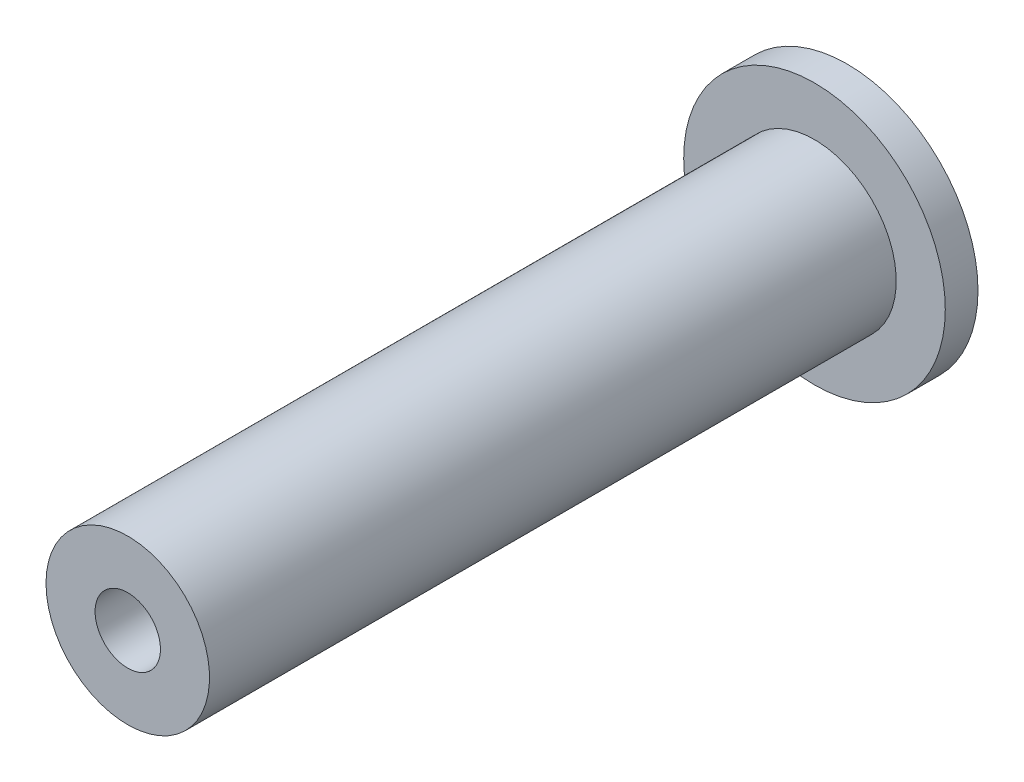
from build123d import *

# Parameters (mm, degrees)
SKETCH_1_R          = 2
EXTRUDE_1_DEPTH     = 0.5
SKETCH_2_R          = 1.25
EXTRUDE_2_DEPTH     = 10.5
SKETCH_3_R          = 0.5
CUT_EXTRUDE_1_DEPTH = 2


with BuildPart() as part:
    # Sketch 1 → Extrude 1 (new body)
    with BuildSketch(Plane.XY):
        Circle(SKETCH_1_R)
    extrude(amount=EXTRUDE_1_DEPTH)

    # Sketch 2 → Extrude 2 (add)
    with BuildSketch(Plane.XY.offset(0.5)):
        with Locations(Location((0, 0, 0), (0, 0, 180))):
            Circle(SKETCH_2_R)
    extrude(amount=EXTRUDE_2_DEPTH)

    # Sketch 3 → Cut-Extrude 1 (cut)
    with BuildSketch(Plane.XY.offset(11)):
        Circle(SKETCH_3_R)
    extrude(amount=-CUT_EXTRUDE_1_DEPTH, mode=Mode.SUBTRACT)


solid = part.part
